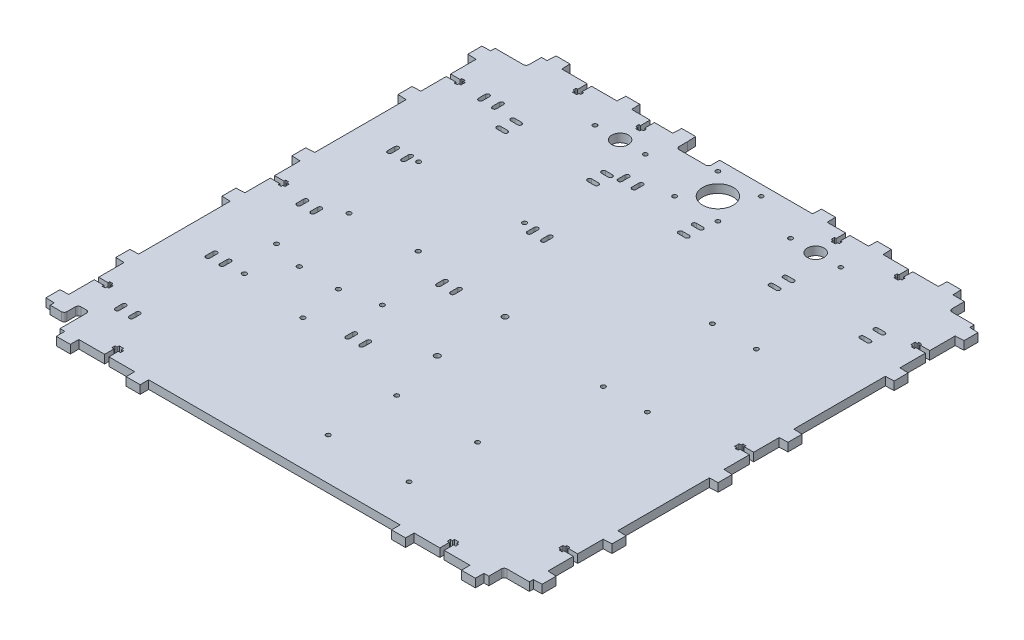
from build123d import *

# Parameters (mm, degrees)
SKETCH_1_R                          = 1.5
SKETCH_1_R_2                        = 5.95
SKETCH_1_R_3                        = 11
EXTRUDE_1_DEPTH                     = 6
FILLET_1_R                          = 2
SKETCH_4_W                          = 23
SKETCH_4_H                          = 8
CUT_EXTRUDE_2_DEPTH                 = 395.936767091
FILLET_2_R                          = 2
SKETCH_2_R                          = 1.5999968
CUT_EXTRUDE_3_DEPTH                 = 395.936767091
SKETCH_3_R                          = 2.05
CUT_EXTRUDE_1_DEPTH                 = 395.936767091
CUT_EXTRUDE_4_DEPTH                 = 395.936767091
CUT_EXTRUDE_4_DEPTH_BACK            = 395.936767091
CUT_EXTRUDE_5_DEPTH                 = 395.936767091
SKETCH_10_W                         = 8
SKETCH_10_H                         = 12
CUT_EXTRUDE_6_DEPTH                 = 395.936767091
FILLET_3_R                          = 2
SKETCH_11_R                         = 1.55
CUT_EXTRUDE_7_DEPTH                 = 395.936767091
SKETCH_12_R                         = 1.55
MKS_BASE_V1_5_MKS_BASE_L_V2_1_DEPTH = 395.936767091
SKETCH_13_R                         = 1.55
CUT_EXTRUDE_8_DEPTH                 = 395.936767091


with BuildPart() as part:
    # Sketch 1 → Extrude 1 (new body)
    with BuildSketch(Plane.XZ):
        Polygon((171.5, 17.1), (171.5, 20.25), (177.6, 20.5), (177.6, 30.5), (171.5, 30.75), (171.5, 48.95), (164.700039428, 48.95), (164.700039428, 47.75), (162.5, 47.75), (162.5, 48.95), (161, 48.95), (161, 52.05), (162.5, 52.05), (162.5, 53.25), (164.700039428, 53.25), (164.700039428, 52.05), (171.5, 52.05), (171.5, 70.25), (177.6, 70.5), (177.6, 80.5), (171.5, 80.75), (171.5, 146.25), (177.6, 146.5), (177.6, 156.5), (171.5, 156.75), (171.5, 174.95), (164.700039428, 174.95), (164.700039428, 173.75), (162.5, 173.75), (162.5, 174.95), (161, 174.95), (161, 178.05), (162.5, 178.05), (162.5, 179.25), (164.700039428, 179.25), (164.700039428, 178.05), (171.5, 178.05), (171.5, 196.25), (177.6, 196.5), (177.6, 206.5), (171.5, 206.75), (171.5, 272.25), (177.6, 272.5), (177.6, 282.5), (171.5, 282.75), (171.5, 300.95), (164.700039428, 300.95), (164.700039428, 299.75), (162.5, 299.75), (162.5, 300.95), (161, 300.95), (161, 304.05), (162.5, 304.05), (162.5, 305.25), (164.700039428, 305.25), (164.700039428, 304.05), (171.5, 304.05), (171.5, 322.25), (177.6, 322.5), (177.6, 332.5), (171.5, 332.75), (171.5, 335.6), (153.5, 335.6), (153.5, 346.6), (150, 346.6), (150, 352.7), (140, 352.7), (140, 346.6), (121.55, 346.6), (121.55, 339.800039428), (123.05, 339.800039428), (123.05, 337.6), (121.55, 337.6), (121.55, 336.1), (118.45, 336.1), (118.45, 337.6), (116.95, 337.6), (116.95, 339.800039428), (118.45, 339.800039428), (118.45, 346.6), (100, 346.6), (100, 352.7), (90, 352.7), (90, 346.6), (-90, 346.6), (-90, 352.7), (-100, 352.7), (-100, 346.6), (-118.45, 346.6), (-118.45, 339.800039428), (-116.95, 339.800039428), (-116.95, 337.6), (-118.45, 337.6), (-118.45, 336.1), (-121.55, 336.1), (-121.55, 337.6), (-123.05, 337.6), (-123.05, 339.800039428), (-121.55, 339.800039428), (-121.55, 346.6), (-140, 346.6), (-140, 352.7), (-150, 352.7), (-150, 346.6), (-153.5, 346.6), (-153.5, 335.6), (-171.5, 335.6), (-171.5, 332.75), (-177.6, 332.5), (-177.6, 322.5), (-171.5, 322.25), (-171.5, 304.05), (-164.700039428, 304.05), (-164.700039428, 305.25), (-162.5, 305.25), (-162.5, 304.05), (-161, 304.05), (-161, 300.95), (-162.5, 300.95), (-162.5, 299.75), (-164.700039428, 299.75), (-164.700039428, 300.95), (-171.5, 300.95), (-171.5, 282.75), (-177.6, 282.5), (-177.6, 272.5), (-171.5, 272.25), (-171.5, 206.75), (-177.6, 206.5), (-177.6, 196.5), (-171.5, 196.25), (-171.5, 178.05), (-164.700039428, 178.05), (-164.700039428, 179.25), (-162.5, 179.25), (-162.5, 178.05), (-161, 178.05), (-161, 174.95), (-162.5, 174.95), (-162.5, 173.75), (-164.700039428, 173.75), (-164.700039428, 174.95), (-171.5, 174.95), (-171.5, 156.75), (-177.6, 156.5), (-177.6, 146.5), (-171.5, 146.25), (-171.5, 80.75), (-177.6, 80.5), (-177.6, 70.5), (-171.5, 70.25), (-171.5, 52.05), (-164.700039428, 52.05), (-164.700039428, 53.25), (-162.5, 53.25), (-162.5, 52.05), (-161, 52.05), (-161, 48.95), (-162.5, 48.95), (-162.5, 47.75), (-164.700039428, 47.75), (-164.700039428, 48.95), (-171.5, 48.95), (-171.5, 30.75), (-177.6, 30.5), (-177.6, 20.5), (-171.5, 20.25), (-171.5, 17.1), (-149.25, 17.1), (-149.25, 6.1), (-145.25, 6.1), (-145, 0), (-135, 0), (-134.75, 6.1), (-116.55, 6.1), (-116.55, 12.899960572), (-117.75, 12.899960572), (-117.75, 15.1), (-116.55, 15.1), (-116.55, 16.6), (-113.45, 16.6), (-113.45, 15.1), (-112.25, 15.1), (-112.25, 12.899960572), (-113.45, 12.899960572), (-113.45, 6.1), (-95.25, 6.1), (-95, 0), (-85, 0), (-84.75, 6.1), (-71.55, 6.1), (-71.55, 12.899960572), (-72.75, 12.899960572), (-72.75, 15.1), (-71.55, 15.1), (-71.55, 16.6), (-68.45, 16.6), (-68.45, 15.1), (-67.25, 15.1), (-67.25, 12.899960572), (-68.45, 12.899960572), (-68.45, 6.1), (-55.25, 6.1), (-55, 0), (-45, 0), (-44.75, 6.1), (44.75, 6.1), (45, 0), (55, 0), (55.25, 6.1), (68.45, 6.1), (68.45, 12.899960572), (67.25, 12.899960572), (67.25, 15.1), (68.45, 15.1), (68.45, 16.6), (71.55, 16.6), (71.55, 15.1), (72.75, 15.1), (72.75, 12.899960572), (71.55, 12.899960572), (71.55, 6.1), (84.75, 6.1), (85, 0), (95, 0), (95.25, 6.1), (113.45, 6.1), (113.45, 12.899960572), (112.25, 12.899960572), (112.25, 15.1), (113.45, 15.1), (113.45, 16.6), (116.55, 16.6), (116.55, 15.1), (117.75, 15.1), (117.75, 12.899960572), (116.55, 12.899960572), (116.55, 6.1), (134.75, 6.1), (135, 0), (145, 0), (145.25, 6.1), (153.5, 6.1), (153.5, 17.1), align=None)
        with Locations(Location((-15.5, 44.6, 0), (0, 0, 270))):
            Circle(SKETCH_1_R, mode=Mode.SUBTRACT)
        with Locations(Location((-15.5, 13.6, 0), (0, 0, 270))):
            Circle(SKETCH_1_R, mode=Mode.SUBTRACT)
        with Locations(Location((-70, 29.1, 0), (0, 0, 270))):
            Circle(SKETCH_1_R_2, mode=Mode.SUBTRACT)
        with Locations(Location((-52, 29.1, 0), (0, 0, 270))):
            Circle(SKETCH_1_R, mode=Mode.SUBTRACT)
        with Locations(Location((-88, 29.1, 0), (0, 0, 270))):
            Circle(SKETCH_1_R, mode=Mode.SUBTRACT)
        with Locations(Location((0, 29.1, 0), (0, 0, 270))):
            Circle(SKETCH_1_R_3, mode=Mode.SUBTRACT)
        with Locations(Location((88, 29.1, 0), (0, 0, 270))):
            Circle(SKETCH_1_R, mode=Mode.SUBTRACT)
        with Locations(Location((52, 29.1, 0), (0, 0, 270))):
            Circle(SKETCH_1_R, mode=Mode.SUBTRACT)
        with Locations(Location((70, 29.1, 0), (0, 0, 270))):
            Circle(SKETCH_1_R_2, mode=Mode.SUBTRACT)
        with Locations(Location((15.5, 13.6, 0), (0, 0, 270))):
            Circle(SKETCH_1_R, mode=Mode.SUBTRACT)
        with Locations(Location((15.5, 44.6, 0), (0, 0, 270))):
            Circle(SKETCH_1_R, mode=Mode.SUBTRACT)
    extrude(amount=-EXTRUDE_1_DEPTH)

    # Fillet 1
    fillet_1_edges = [part.edges().sort_by_distance(p)[0] for p in [
        (-149.25, 3, 17.1),
        (-153.5, 3, 335.6),
        (153.5, 3, 335.6),
        (153.5, 3, 17.1),
    ]]
    fillet(fillet_1_edges, radius=FILLET_1_R)

    # Sketch 4 → Cut-Extrude 2 (cut, through all)
    with BuildSketch(Plane.XZ.offset(-6)):
        with Locations((-33.25, 10.1)):
            Rectangle(SKETCH_4_W, SKETCH_4_H)
    extrude(amount=CUT_EXTRUDE_2_DEPTH, mode=Mode.SUBTRACT)

    # Fillet 2
    fillet_2_edges = [part.edges().sort_by_distance(p)[0] for p in [
        (-44.75, 3, 14.1),
        (-21.75, 3, 14.1),
    ]]
    fillet(fillet_2_edges, radius=FILLET_2_R)

    # Sketch 2 → Cut-Extrude 3 (cut, through all)
    with BuildSketch(Plane.XZ):
        with Locations(Location((-73.24, 252.95, 0), (0, 0, 270))):
            Circle(SKETCH_2_R)
        with Locations(Location((-121.5, 171.67, 0), (0, 0, 270))):
            Circle(SKETCH_2_R)
        with Locations(Location((-121.5, 246.6, 0), (0, 0, 270))):
            Circle(SKETCH_2_R)
        with Locations(Location((-73.24, 170.4, 0), (0, 0, 270))):
            Circle(SKETCH_2_R)
        with Locations(Location((-106.26, 222.47, 0), (0, 0, 270))):
            Circle(SKETCH_2_R)
        with Locations(Location((-78.32, 222.47, 0), (0, 0, 270))):
            Circle(SKETCH_2_R)
    extrude(amount=-CUT_EXTRUDE_3_DEPTH, mode=Mode.SUBTRACT)

    # Sketch 3 → Cut-Extrude 1 (cut, through all)
    with BuildSketch(Plane.XZ):
        with Locations(Location((-1.5, 228.5, 0), (0, 0, 270))):
            Circle(SKETCH_3_R)
        with Locations(Location((-1.5, 180, 0), (0, 0, 270))):
            Circle(SKETCH_3_R)
    extrude(amount=-CUT_EXTRUDE_1_DEPTH, mode=Mode.SUBTRACT)

    # Sketch 8 → Cut-Extrude 4 (cut, two sides: drawn at the far end of the back side and taken through both)
    with BuildSketch(Plane.XZ.offset(-CUT_EXTRUDE_4_DEPTH_BACK)):
        with BuildLine():
            Line((-143.5, 249.1), (-143.5, 244.1))
            ThreePointArc((-143.5, 244.1), (-145, 242.6), (-146.5, 244.1))
            Line((-146.5, 244.1), (-146.5, 249.1))
            ThreePointArc((-146.5, 249.1), (-145, 250.6), (-143.5, 249.1))
        make_face()
        with BuildLine():
            Line((-43.5, 249.1), (-43.5, 244.1))
            ThreePointArc((-43.5, 244.1), (-45, 242.6), (-46.5, 244.1))
            Line((-46.5, 244.1), (-46.5, 249.1))
            ThreePointArc((-46.5, 249.1), (-45, 250.6), (-43.5, 249.1))
        make_face()
        with BuildLine():
            Line((-43.5, 184.1), (-43.5, 179.1))
            ThreePointArc((-43.5, 179.1), (-45, 177.6), (-46.5, 179.1))
            Line((-46.5, 179.1), (-46.5, 184.1))
            ThreePointArc((-46.5, 184.1), (-45, 185.6), (-43.5, 184.1))
        make_face()
        with BuildLine():
            Line((-43.5, 119.1), (-43.5, 114.1))
            ThreePointArc((-43.5, 114.1), (-45, 112.6), (-46.5, 114.1))
            Line((-46.5, 114.1), (-46.5, 119.1))
            ThreePointArc((-46.5, 119.1), (-45, 120.6), (-43.5, 119.1))
        make_face()
        with BuildLine():
            Line((-43.5, 54.1), (-43.5, 49.1))
            ThreePointArc((-43.5, 49.1), (-45, 47.6), (-46.5, 49.1))
            Line((-46.5, 49.1), (-46.5, 54.1))
            ThreePointArc((-46.5, 54.1), (-45, 55.6), (-43.5, 54.1))
        make_face()
        with BuildLine():
            Line((-143.5, 314.1), (-143.5, 309.1))
            ThreePointArc((-143.5, 309.1), (-145, 307.6), (-146.5, 309.1))
            Line((-146.5, 309.1), (-146.5, 314.1))
            ThreePointArc((-146.5, 314.1), (-145, 315.6), (-143.5, 314.1))
        make_face()
        with BuildLine():
            Line((-143.5, 184.1), (-143.5, 179.1))
            ThreePointArc((-143.5, 179.1), (-145, 177.6), (-146.5, 179.1))
            Line((-146.5, 179.1), (-146.5, 184.1))
            ThreePointArc((-146.5, 184.1), (-145, 185.6), (-143.5, 184.1))
        make_face()
        with BuildLine():
            Line((-143.5, 119.1), (-143.5, 114.1))
            ThreePointArc((-143.5, 114.1), (-145, 112.6), (-146.5, 114.1))
            Line((-146.5, 114.1), (-146.5, 119.1))
            ThreePointArc((-146.5, 119.1), (-145, 120.6), (-143.5, 119.1))
        make_face()
        with BuildLine():
            Line((-143.5, 54.1), (-143.5, 49.1))
            ThreePointArc((-143.5, 49.1), (-145, 47.6), (-146.5, 49.1))
            Line((-146.5, 49.1), (-146.5, 54.1))
            ThreePointArc((-146.5, 54.1), (-145, 55.6), (-143.5, 54.1))
        make_face()
        with BuildLine():
            Line((-136.5, 314.1), (-136.5, 309.1))
            ThreePointArc((-136.5, 309.1), (-135, 307.6), (-133.5, 309.1))
            Line((-133.5, 309.1), (-133.5, 314.1))
            ThreePointArc((-133.5, 314.1), (-135, 315.6), (-136.5, 314.1))
        make_face()
        with BuildLine():
            Line((-136.5, 54.1), (-136.5, 49.1))
            ThreePointArc((-136.5, 49.1), (-135, 47.6), (-133.5, 49.1))
            Line((-133.5, 49.1), (-133.5, 54.1))
            ThreePointArc((-133.5, 54.1), (-135, 55.6), (-136.5, 54.1))
        make_face()
        with BuildLine():
            Line((-136.5, 119.1), (-136.5, 114.1))
            ThreePointArc((-136.5, 114.1), (-135, 112.6), (-133.5, 114.1))
            Line((-133.5, 114.1), (-133.5, 119.1))
            ThreePointArc((-133.5, 119.1), (-135, 120.6), (-136.5, 119.1))
        make_face()
        with BuildLine():
            Line((-136.5, 184.1), (-136.5, 179.1))
            ThreePointArc((-136.5, 179.1), (-135, 177.6), (-133.5, 179.1))
            Line((-133.5, 179.1), (-133.5, 184.1))
            ThreePointArc((-133.5, 184.1), (-135, 185.6), (-136.5, 184.1))
        make_face()
        with BuildLine():
            Line((-136.5, 249.1), (-136.5, 244.1))
            ThreePointArc((-136.5, 244.1), (-135, 242.6), (-133.5, 244.1))
            Line((-133.5, 244.1), (-133.5, 249.1))
            ThreePointArc((-133.5, 249.1), (-135, 250.6), (-136.5, 249.1))
        make_face()
        with BuildLine():
            Line((-36.5, 54.1), (-36.5, 49.1))
            ThreePointArc((-36.5, 49.1), (-35, 47.6), (-33.5, 49.1))
            Line((-33.5, 49.1), (-33.5, 54.1))
            ThreePointArc((-33.5, 54.1), (-35, 55.6), (-36.5, 54.1))
        make_face()
        with BuildLine():
            Line((-36.5, 119.1), (-36.5, 114.1))
            ThreePointArc((-36.5, 114.1), (-35, 112.6), (-33.5, 114.1))
            Line((-33.5, 114.1), (-33.5, 119.1))
            ThreePointArc((-33.5, 119.1), (-35, 120.6), (-36.5, 119.1))
        make_face()
        with BuildLine():
            Line((-36.5, 184.1), (-36.5, 179.1))
            ThreePointArc((-36.5, 179.1), (-35, 177.6), (-33.5, 179.1))
            Line((-33.5, 179.1), (-33.5, 184.1))
            ThreePointArc((-33.5, 184.1), (-35, 185.6), (-36.5, 184.1))
        make_face()
        with BuildLine():
            Line((-36.5, 249.1), (-36.5, 244.1))
            ThreePointArc((-36.5, 244.1), (-35, 242.6), (-33.5, 244.1))
            Line((-33.5, 244.1), (-33.5, 249.1))
            ThreePointArc((-33.5, 249.1), (-35, 250.6), (-36.5, 249.1))
        make_face()
    extrude(amount=CUT_EXTRUDE_4_DEPTH + CUT_EXTRUDE_4_DEPTH_BACK, mode=Mode.SUBTRACT)

    # Sketch 9 → Cut-Extrude 5 (cut, through all)
    with BuildSketch(Plane.XZ):
        with BuildLine():
            Line((144, 63.5), (139, 63.5))
            ThreePointArc((139, 63.5), (137.5, 65), (139, 66.5))
            Line((139, 66.5), (144, 66.5))
            ThreePointArc((144, 66.5), (145.5, 65), (144, 63.5))
        make_face()
        with BuildLine():
            Line((79, 63.5), (74, 63.5))
            ThreePointArc((74, 63.5), (72.5, 65), (74, 66.5))
            Line((74, 66.5), (79, 66.5))
            ThreePointArc((79, 66.5), (80.5, 65), (79, 63.5))
        make_face()
        with BuildLine():
            Line((14, 63.5), (9, 63.5))
            ThreePointArc((9, 63.5), (7.5, 65), (9, 66.5))
            Line((9, 66.5), (14, 66.5))
            ThreePointArc((14, 66.5), (15.5, 65), (14, 63.5))
        make_face()
        with BuildLine():
            Line((-51, 63.5), (-56, 63.5))
            ThreePointArc((-56, 63.5), (-57.5, 65), (-56, 66.5))
            Line((-56, 66.5), (-51, 66.5))
            ThreePointArc((-51, 66.5), (-49.5, 65), (-51, 63.5))
        make_face()
        with BuildLine():
            Line((-116, 63.5), (-121, 63.5))
            ThreePointArc((-121, 63.5), (-122.5, 65), (-121, 66.5))
            Line((-121, 66.5), (-116, 66.5))
            ThreePointArc((-116, 66.5), (-114.5, 65), (-116, 63.5))
        make_face()
        with BuildLine():
            Line((-116, 56.5), (-121, 56.5))
            ThreePointArc((-121, 56.5), (-122.5, 55), (-121, 53.5))
            Line((-121, 53.5), (-116, 53.5))
            ThreePointArc((-116, 53.5), (-114.5, 55), (-116, 56.5))
        make_face()
        with BuildLine():
            Line((-51, 56.5), (-56, 56.5))
            ThreePointArc((-56, 56.5), (-57.5, 55), (-56, 53.5))
            Line((-56, 53.5), (-51, 53.5))
            ThreePointArc((-51, 53.5), (-49.5, 55), (-51, 56.5))
        make_face()
        with BuildLine():
            Line((14, 56.5), (9, 56.5))
            ThreePointArc((9, 56.5), (7.5, 55), (9, 53.5))
            Line((9, 53.5), (14, 53.5))
            ThreePointArc((14, 53.5), (15.5, 55), (14, 56.5))
        make_face()
        with BuildLine():
            Line((79, 56.5), (74, 56.5))
            ThreePointArc((74, 56.5), (72.5, 55), (74, 53.5))
            Line((74, 53.5), (79, 53.5))
            ThreePointArc((79, 53.5), (80.5, 55), (79, 56.5))
        make_face()
        with BuildLine():
            Line((144, 56.5), (139, 56.5))
            ThreePointArc((139, 56.5), (137.5, 55), (139, 53.5))
            Line((139, 53.5), (144, 53.5))
            ThreePointArc((144, 53.5), (145.5, 55), (144, 56.5))
        make_face()
    extrude(amount=-CUT_EXTRUDE_5_DEPTH, mode=Mode.SUBTRACT)

    # Sketch 10 → Cut-Extrude 6 (cut, through all)
    with BuildSketch(Plane.XZ):
        with Locations((-157.5, 331.6)):
            Rectangle(SKETCH_10_W, SKETCH_10_H)
    extrude(amount=-CUT_EXTRUDE_6_DEPTH, mode=Mode.SUBTRACT)

    # Fillet 3
    fillet_3_edges = [part.edges().sort_by_distance(p)[0] for p in [
        (-161.5, 3, 335.6),
        (-153.5, 3, 325.6),
        (-161.5, 3, 325.6),
    ]]
    fillet(fillet_3_edges, radius=FILLET_3_R)

    # Sketch 11 → Cut-Extrude 7 (cut, through all)
    with BuildSketch(Plane.XZ):
        with Locations(Location((77, 188.1, 0), (0, 0, 270))):
            Circle(SKETCH_11_R)
        with Locations(Location((108.5, 188.1, 0), (0, 0, 270))):
            Circle(SKETCH_11_R)
        with Locations(Location((108.5, 110.1, 0), (0, 0, 270))):
            Circle(SKETCH_11_R)
        with Locations(Location((77, 110.1, 0), (0, 0, 270))):
            Circle(SKETCH_11_R)
    extrude(amount=-CUT_EXTRUDE_7_DEPTH, mode=Mode.SUBTRACT)

    # Sketch 12 → MKS BASE V1.5_MKS BASE-L V2.1 (cut, through all)
    with BuildSketch(Plane.XZ):
        with Locations(Location((-128.5, 216.6, 0), (0, 0, 270))):
            Circle(SKETCH_12_R)
        with Locations(Location((-52.7, 216.6, 0), (0, 0, 270))):
            Circle(SKETCH_12_R)
        with Locations(Location((-52.7, 114.8, 0), (0, 0, 270))):
            Circle(SKETCH_12_R)
        with Locations(Location((-128.5, 114.8, 0), (0, 0, 270))):
            Circle(SKETCH_12_R)
    extrude(amount=-MKS_BASE_V1_5_MKS_BASE_L_V2_1_DEPTH, mode=Mode.SUBTRACT)

    # Sketch 13 → Cut-Extrude 8 (cut, through all)
    with BuildSketch(Plane.XZ):
        with Locations(Location((8.5, 316.6, 0), (0, 0, 270))):
            Circle(SKETCH_13_R)
        with Locations(Location((8.5, 267.6, 0), (0, 0, 270))):
            Circle(SKETCH_13_R)
        with Locations(Location((66.5, 316.6, 0), (0, 0, 270))):
            Circle(SKETCH_13_R)
        with Locations(Location((66.5, 267.6, 0), (0, 0, 270))):
            Circle(SKETCH_13_R)
    extrude(amount=-CUT_EXTRUDE_8_DEPTH, mode=Mode.SUBTRACT)


solid = part.part
